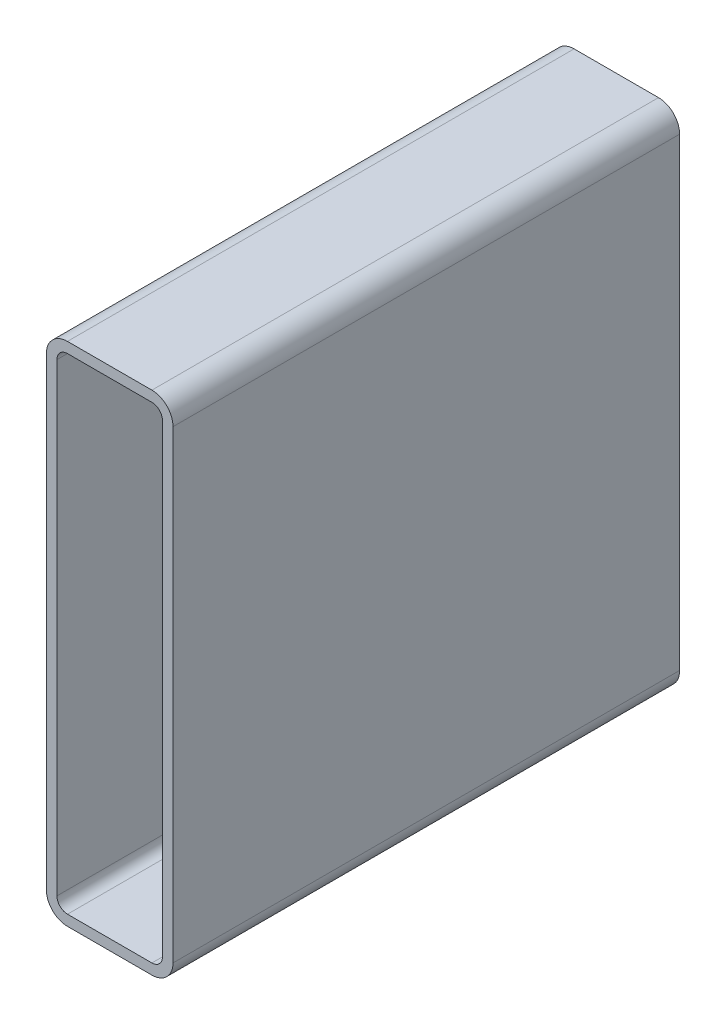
ISO-10303-21;
HEADER;
FILE_DESCRIPTION(('STEP AP214'),'2;1');
FILE_NAME('part.step','',(''),(''),'','','');
FILE_SCHEMA(('AUTOMOTIVE_DESIGN { 1 0 10303 214 1 1 1 1 }'));
ENDSEC;
DATA;
#1=APPLICATION_CONTEXT('core data for automotive mechanical design processes');
#2=APPLICATION_PROTOCOL_DEFINITION('international standard','automotive_design',2000,#1);
#3=PRODUCT_CONTEXT('',#1,'mechanical');
#4=PRODUCT('Part','Part','',(#3));
#5=PRODUCT_RELATED_PRODUCT_CATEGORY('part','',(#4));
#6=PRODUCT_DEFINITION_FORMATION('','',#4);
#7=PRODUCT_DEFINITION_CONTEXT('part definition',#1,'design');
#8=PRODUCT_DEFINITION('design','',#6,#7);
#9=PRODUCT_DEFINITION_SHAPE('','',#8);
#10=(LENGTH_UNIT() NAMED_UNIT(*) SI_UNIT(.MILLI.,.METRE.));
#11=(NAMED_UNIT(*) PLANE_ANGLE_UNIT() SI_UNIT($,.RADIAN.));
#12=(NAMED_UNIT(*) SI_UNIT($,.STERADIAN.) SOLID_ANGLE_UNIT());
#13=UNCERTAINTY_MEASURE_WITH_UNIT(LENGTH_MEASURE(1.E-05),#10,'distance_accuracy_value','');
#14=(GEOMETRIC_REPRESENTATION_CONTEXT(3) GLOBAL_UNCERTAINTY_ASSIGNED_CONTEXT((#13)) GLOBAL_UNIT_ASSIGNED_CONTEXT((#10,
#11,#12)) REPRESENTATION_CONTEXT('',''));
#15=CARTESIAN_POINT('',(0.,0.,0.));
#16=DIRECTION('',(0.,0.,1.));
#17=DIRECTION('',(1.,0.,0.));
#18=AXIS2_PLACEMENT_3D('',#15,#16,#17);
#19=CARTESIAN_POINT('',(15.1891160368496,293.974496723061,304.8));
#20=DIRECTION('',(0.,0.,1.));
#21=DIRECTION('',(1.,0.,0.));
#22=AXIS2_PLACEMENT_3D('',#19,#20,#21);
#23=PLANE('',#22);
#24=CARTESIAN_POINT('',(15.1891160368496,293.974496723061,304.8));
#25=DIRECTION('',(0.,0.,1.));
#26=DIRECTION('',(1.,0.,0.));
#27=AXIS2_PLACEMENT_3D('',#24,#25,#26);
#28=CIRCLE('',#27,12.7);
#29=CARTESIAN_POINT('',(15.1891160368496,306.674496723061,304.8));
#30=VERTEX_POINT('',#29);
#31=CARTESIAN_POINT('',(2.48911603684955,293.974496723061,304.8));
#32=VERTEX_POINT('',#31);
#33=EDGE_CURVE('E211',#30,#32,#28,.T.);
#34=ORIENTED_EDGE('',*,*,#33,.T.);
#35=DIRECTION('',(0.,-1.,0.));
#36=VECTOR('',#35,1.);
#37=CARTESIAN_POINT('',(2.48911603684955,14.5744967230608,304.8));
#38=LINE('',#37,#36);
#39=CARTESIAN_POINT('',(2.48911603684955,14.5744967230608,304.8));
#40=VERTEX_POINT('',#39);
#41=EDGE_CURVE('E214',#32,#40,#38,.T.);
#42=ORIENTED_EDGE('',*,*,#41,.T.);
#43=CARTESIAN_POINT('',(15.1891160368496,14.5744967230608,304.8));
#44=DIRECTION('',(0.,0.,1.));
#45=DIRECTION('',(1.,0.,0.));
#46=AXIS2_PLACEMENT_3D('',#43,#44,#45);
#47=CIRCLE('',#46,12.7);
#48=CARTESIAN_POINT('',(15.1891160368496,1.87449672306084,304.8));
#49=VERTEX_POINT('',#48);
#50=EDGE_CURVE('E217',#40,#49,#47,.T.);
#51=ORIENTED_EDGE('',*,*,#50,.T.);
#52=DIRECTION('',(1.,0.,0.));
#53=VECTOR('',#52,1.);
#54=CARTESIAN_POINT('',(65.9891160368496,1.87449672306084,304.8));
#55=LINE('',#54,#53);
#56=CARTESIAN_POINT('',(65.9891160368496,1.87449672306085,304.8));
#57=VERTEX_POINT('',#56);
#58=EDGE_CURVE('E219',#49,#57,#55,.T.);
#59=ORIENTED_EDGE('',*,*,#58,.T.);
#60=CARTESIAN_POINT('',(65.9891160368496,14.5744967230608,304.8));
#61=DIRECTION('',(0.,0.,1.));
#62=DIRECTION('',(1.,0.,0.));
#63=AXIS2_PLACEMENT_3D('',#60,#61,#62);
#64=CIRCLE('',#63,12.7);
#65=CARTESIAN_POINT('',(78.6891160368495,14.5744967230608,304.8));
#66=VERTEX_POINT('',#65);
#67=EDGE_CURVE('E221',#57,#66,#64,.T.);
#68=ORIENTED_EDGE('',*,*,#67,.T.);
#69=DIRECTION('',(0.,1.,0.));
#70=VECTOR('',#69,1.);
#71=CARTESIAN_POINT('',(78.6891160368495,293.974496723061,304.8));
#72=LINE('',#71,#70);
#73=CARTESIAN_POINT('',(78.6891160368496,293.974496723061,304.8));
#74=VERTEX_POINT('',#73);
#75=EDGE_CURVE('E223',#66,#74,#72,.T.);
#76=ORIENTED_EDGE('',*,*,#75,.T.);
#77=CARTESIAN_POINT('',(65.9891160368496,293.974496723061,304.8));
#78=DIRECTION('',(0.,0.,1.));
#79=DIRECTION('',(1.,0.,0.));
#80=AXIS2_PLACEMENT_3D('',#77,#78,#79);
#81=CIRCLE('',#80,12.7);
#82=CARTESIAN_POINT('',(65.9891160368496,306.674496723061,304.8));
#83=VERTEX_POINT('',#82);
#84=EDGE_CURVE('E225',#74,#83,#81,.T.);
#85=ORIENTED_EDGE('',*,*,#84,.T.);
#86=DIRECTION('',(-1.,0.,0.));
#87=VECTOR('',#86,1.);
#88=CARTESIAN_POINT('',(15.1891160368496,306.674496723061,304.8));
#89=LINE('',#88,#87);
#90=EDGE_CURVE('E227',#83,#30,#89,.T.);
#91=ORIENTED_EDGE('',*,*,#90,.T.);
#92=EDGE_LOOP('',(#34,#42,#51,#59,#68,#76,#85,#91));
#93=FACE_BOUND('',#92,.T.);
#94=DIRECTION('',(0.,-1.,0.));
#95=VECTOR('',#94,1.);
#96=CARTESIAN_POINT('',(8.83911603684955,14.5744967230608,304.8));
#97=LINE('',#96,#95);
#98=CARTESIAN_POINT('',(8.83911603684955,293.974496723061,304.8));
#99=VERTEX_POINT('',#98);
#100=CARTESIAN_POINT('',(8.83911603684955,14.5744967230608,304.8));
#101=VERTEX_POINT('',#100);
#102=EDGE_CURVE('E154',#99,#101,#97,.T.);
#103=ORIENTED_EDGE('',*,*,#102,.F.);
#104=CARTESIAN_POINT('',(15.1891160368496,293.974496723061,304.8));
#105=DIRECTION('',(0.,0.,1.));
#106=DIRECTION('',(1.,0.,0.));
#107=AXIS2_PLACEMENT_3D('',#104,#105,#106);
#108=CIRCLE('',#107,6.35000000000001);
#109=CARTESIAN_POINT('',(15.1891160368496,300.324496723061,304.8));
#110=VERTEX_POINT('',#109);
#111=EDGE_CURVE('E146',#110,#99,#108,.T.);
#112=ORIENTED_EDGE('',*,*,#111,.F.);
#113=DIRECTION('',(-1.,0.,0.));
#114=VECTOR('',#113,1.);
#115=CARTESIAN_POINT('',(15.1891160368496,300.324496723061,304.8));
#116=LINE('',#115,#114);
#117=CARTESIAN_POINT('',(65.9891160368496,300.324496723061,304.8));
#118=VERTEX_POINT('',#117);
#119=EDGE_CURVE('E179',#118,#110,#116,.T.);
#120=ORIENTED_EDGE('',*,*,#119,.F.);
#121=CARTESIAN_POINT('',(65.9891160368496,293.974496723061,304.8));
#122=DIRECTION('',(0.,0.,1.));
#123=DIRECTION('',(1.,0.,0.));
#124=AXIS2_PLACEMENT_3D('',#121,#122,#123);
#125=CIRCLE('',#124,6.35000000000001);
#126=CARTESIAN_POINT('',(72.3391160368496,293.974496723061,304.8));
#127=VERTEX_POINT('',#126);
#128=EDGE_CURVE('E177',#127,#118,#125,.T.);
#129=ORIENTED_EDGE('',*,*,#128,.F.);
#130=DIRECTION('',(0.,1.,0.));
#131=VECTOR('',#130,1.);
#132=CARTESIAN_POINT('',(72.3391160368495,293.974496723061,304.8));
#133=LINE('',#132,#131);
#134=CARTESIAN_POINT('',(72.3391160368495,14.5744967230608,304.8));
#135=VERTEX_POINT('',#134);
#136=EDGE_CURVE('E175',#135,#127,#133,.T.);
#137=ORIENTED_EDGE('',*,*,#136,.F.);
#138=CARTESIAN_POINT('',(65.9891160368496,14.5744967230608,304.8));
#139=DIRECTION('',(0.,0.,1.));
#140=DIRECTION('',(1.,0.,0.));
#141=AXIS2_PLACEMENT_3D('',#138,#139,#140);
#142=CIRCLE('',#141,6.35);
#143=CARTESIAN_POINT('',(65.9891160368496,8.22449672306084,304.8));
#144=VERTEX_POINT('',#143);
#145=EDGE_CURVE('E173',#144,#135,#142,.T.);
#146=ORIENTED_EDGE('',*,*,#145,.F.);
#147=DIRECTION('',(1.,0.,0.));
#148=VECTOR('',#147,1.);
#149=CARTESIAN_POINT('',(65.9891160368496,8.22449672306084,304.8));
#150=LINE('',#149,#148);
#151=CARTESIAN_POINT('',(15.1891160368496,8.22449672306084,304.8));
#152=VERTEX_POINT('',#151);
#153=EDGE_CURVE('E169',#152,#144,#150,.T.);
#154=ORIENTED_EDGE('',*,*,#153,.F.);
#155=CARTESIAN_POINT('',(15.1891160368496,14.5744967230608,304.8));
#156=DIRECTION('',(0.,0.,1.));
#157=DIRECTION('',(1.,0.,0.));
#158=AXIS2_PLACEMENT_3D('',#155,#156,#157);
#159=CIRCLE('',#158,6.35);
#160=EDGE_CURVE('E167',#101,#152,#159,.T.);
#161=ORIENTED_EDGE('',*,*,#160,.F.);
#162=EDGE_LOOP('',(#103,#112,#120,#129,#137,#146,#154,#161));
#163=FACE_BOUND('',#162,.T.);
#164=ADVANCED_FACE('F33',(#93,#163),#23,.T.);
#165=CARTESIAN_POINT('',(15.1891160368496,293.974496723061,0.));
#166=DIRECTION('',(0.,0.,1.));
#167=DIRECTION('',(1.,0.,0.));
#168=AXIS2_PLACEMENT_3D('',#165,#166,#167);
#169=PLANE('',#168);
#170=CARTESIAN_POINT('',(15.1891160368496,293.974496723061,0.));
#171=DIRECTION('',(0.,0.,1.));
#172=DIRECTION('',(1.,0.,0.));
#173=AXIS2_PLACEMENT_3D('',#170,#171,#172);
#174=CIRCLE('',#173,12.7);
#175=CARTESIAN_POINT('',(15.1891160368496,306.674496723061,0.));
#176=VERTEX_POINT('',#175);
#177=CARTESIAN_POINT('',(2.48911603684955,293.974496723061,0.));
#178=VERTEX_POINT('',#177);
#179=EDGE_CURVE('E162',#176,#178,#174,.T.);
#180=ORIENTED_EDGE('',*,*,#179,.F.);
#181=DIRECTION('',(-1.,0.,0.));
#182=VECTOR('',#181,1.);
#183=CARTESIAN_POINT('',(15.1891160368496,306.674496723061,0.));
#184=LINE('',#183,#182);
#185=CARTESIAN_POINT('',(65.9891160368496,306.674496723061,0.));
#186=VERTEX_POINT('',#185);
#187=EDGE_CURVE('E215',#186,#176,#184,.T.);
#188=ORIENTED_EDGE('',*,*,#187,.F.);
#189=CARTESIAN_POINT('',(65.9891160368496,293.974496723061,0.));
#190=DIRECTION('',(0.,0.,1.));
#191=DIRECTION('',(1.,0.,0.));
#192=AXIS2_PLACEMENT_3D('',#189,#190,#191);
#193=CIRCLE('',#192,12.7);
#194=CARTESIAN_POINT('',(78.6891160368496,293.974496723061,0.));
#195=VERTEX_POINT('',#194);
#196=EDGE_CURVE('E242',#195,#186,#193,.T.);
#197=ORIENTED_EDGE('',*,*,#196,.F.);
#198=DIRECTION('',(0.,1.,0.));
#199=VECTOR('',#198,1.);
#200=CARTESIAN_POINT('',(78.6891160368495,293.974496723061,0.));
#201=LINE('',#200,#199);
#202=CARTESIAN_POINT('',(78.6891160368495,14.5744967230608,0.));
#203=VERTEX_POINT('',#202);
#204=EDGE_CURVE('E240',#203,#195,#201,.T.);
#205=ORIENTED_EDGE('',*,*,#204,.F.);
#206=CARTESIAN_POINT('',(65.9891160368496,14.5744967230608,0.));
#207=DIRECTION('',(0.,0.,1.));
#208=DIRECTION('',(1.,0.,0.));
#209=AXIS2_PLACEMENT_3D('',#206,#207,#208);
#210=CIRCLE('',#209,12.7);
#211=CARTESIAN_POINT('',(65.9891160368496,1.87449672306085,0.));
#212=VERTEX_POINT('',#211);
#213=EDGE_CURVE('E238',#212,#203,#210,.T.);
#214=ORIENTED_EDGE('',*,*,#213,.F.);
#215=DIRECTION('',(1.,0.,0.));
#216=VECTOR('',#215,1.);
#217=CARTESIAN_POINT('',(65.9891160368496,1.87449672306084,0.));
#218=LINE('',#217,#216);
#219=CARTESIAN_POINT('',(15.1891160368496,1.87449672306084,0.));
#220=VERTEX_POINT('',#219);
#221=EDGE_CURVE('E236',#220,#212,#218,.T.);
#222=ORIENTED_EDGE('',*,*,#221,.F.);
#223=CARTESIAN_POINT('',(15.1891160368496,14.5744967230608,0.));
#224=DIRECTION('',(0.,0.,1.));
#225=DIRECTION('',(1.,0.,0.));
#226=AXIS2_PLACEMENT_3D('',#223,#224,#225);
#227=CIRCLE('',#226,12.7);
#228=CARTESIAN_POINT('',(2.48911603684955,14.5744967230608,0.));
#229=VERTEX_POINT('',#228);
#230=EDGE_CURVE('E234',#229,#220,#227,.T.);
#231=ORIENTED_EDGE('',*,*,#230,.F.);
#232=DIRECTION('',(0.,-1.,0.));
#233=VECTOR('',#232,1.);
#234=CARTESIAN_POINT('',(2.48911603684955,14.5744967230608,0.));
#235=LINE('',#234,#233);
#236=EDGE_CURVE('E232',#178,#229,#235,.T.);
#237=ORIENTED_EDGE('',*,*,#236,.F.);
#238=EDGE_LOOP('',(#180,#188,#197,#205,#214,#222,#231,#237));
#239=FACE_BOUND('',#238,.T.);
#240=CARTESIAN_POINT('',(15.1891160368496,293.974496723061,0.));
#241=DIRECTION('',(0.,0.,1.));
#242=DIRECTION('',(1.,0.,0.));
#243=AXIS2_PLACEMENT_3D('',#240,#241,#242);
#244=CIRCLE('',#243,6.35000000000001);
#245=CARTESIAN_POINT('',(15.1891160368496,300.324496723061,0.));
#246=VERTEX_POINT('',#245);
#247=CARTESIAN_POINT('',(8.83911603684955,293.974496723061,0.));
#248=VERTEX_POINT('',#247);
#249=EDGE_CURVE('E56',#246,#248,#244,.T.);
#250=ORIENTED_EDGE('',*,*,#249,.T.);
#251=DIRECTION('',(0.,-1.,0.));
#252=VECTOR('',#251,1.);
#253=CARTESIAN_POINT('',(8.83911603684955,14.5744967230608,0.));
#254=LINE('',#253,#252);
#255=CARTESIAN_POINT('',(8.83911603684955,14.5744967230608,0.));
#256=VERTEX_POINT('',#255);
#257=EDGE_CURVE('E161',#248,#256,#254,.T.);
#258=ORIENTED_EDGE('',*,*,#257,.T.);
#259=CARTESIAN_POINT('',(15.1891160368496,14.5744967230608,0.));
#260=DIRECTION('',(0.,0.,1.));
#261=DIRECTION('',(1.,0.,0.));
#262=AXIS2_PLACEMENT_3D('',#259,#260,#261);
#263=CIRCLE('',#262,6.35);
#264=CARTESIAN_POINT('',(15.1891160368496,8.22449672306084,0.));
#265=VERTEX_POINT('',#264);
#266=EDGE_CURVE('E183',#256,#265,#263,.T.);
#267=ORIENTED_EDGE('',*,*,#266,.T.);
#268=DIRECTION('',(1.,0.,0.));
#269=VECTOR('',#268,1.);
#270=CARTESIAN_POINT('',(65.9891160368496,8.22449672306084,0.));
#271=LINE('',#270,#269);
#272=CARTESIAN_POINT('',(65.9891160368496,8.22449672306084,0.));
#273=VERTEX_POINT('',#272);
#274=EDGE_CURVE('E186',#265,#273,#271,.T.);
#275=ORIENTED_EDGE('',*,*,#274,.T.);
#276=CARTESIAN_POINT('',(65.9891160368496,14.5744967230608,0.));
#277=DIRECTION('',(0.,0.,1.));
#278=DIRECTION('',(1.,0.,0.));
#279=AXIS2_PLACEMENT_3D('',#276,#277,#278);
#280=CIRCLE('',#279,6.35);
#281=CARTESIAN_POINT('',(72.3391160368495,14.5744967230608,0.));
#282=VERTEX_POINT('',#281);
#283=EDGE_CURVE('E189',#273,#282,#280,.T.);
#284=ORIENTED_EDGE('',*,*,#283,.T.);
#285=DIRECTION('',(0.,1.,0.));
#286=VECTOR('',#285,1.);
#287=CARTESIAN_POINT('',(72.3391160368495,293.974496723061,0.));
#288=LINE('',#287,#286);
#289=CARTESIAN_POINT('',(72.3391160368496,293.974496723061,0.));
#290=VERTEX_POINT('',#289);
#291=EDGE_CURVE('E192',#282,#290,#288,.T.);
#292=ORIENTED_EDGE('',*,*,#291,.T.);
#293=CARTESIAN_POINT('',(65.9891160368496,293.974496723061,0.));
#294=DIRECTION('',(0.,0.,1.));
#295=DIRECTION('',(1.,0.,0.));
#296=AXIS2_PLACEMENT_3D('',#293,#294,#295);
#297=CIRCLE('',#296,6.35000000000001);
#298=CARTESIAN_POINT('',(65.9891160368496,300.324496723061,0.));
#299=VERTEX_POINT('',#298);
#300=EDGE_CURVE('E195',#290,#299,#297,.T.);
#301=ORIENTED_EDGE('',*,*,#300,.T.);
#302=DIRECTION('',(-1.,0.,0.));
#303=VECTOR('',#302,1.);
#304=CARTESIAN_POINT('',(15.1891160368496,300.324496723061,0.));
#305=LINE('',#304,#303);
#306=EDGE_CURVE('E155',#299,#246,#305,.T.);
#307=ORIENTED_EDGE('',*,*,#306,.T.);
#308=EDGE_LOOP('',(#250,#258,#267,#275,#284,#292,#301,#307));
#309=FACE_BOUND('',#308,.T.);
#310=ADVANCED_FACE('F272',(#239,#309),#169,.F.);
#311=CARTESIAN_POINT('',(15.1891160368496,293.974496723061,304.8));
#312=DIRECTION('',(0.,0.,-1.));
#313=DIRECTION('',(-1.,0.,0.));
#314=AXIS2_PLACEMENT_3D('',#311,#312,#313);
#315=CYLINDRICAL_SURFACE('',#314,12.7);
#316=ORIENTED_EDGE('',*,*,#179,.T.);
#317=DIRECTION('',(0.,0.,-1.));
#318=VECTOR('',#317,1.);
#319=CARTESIAN_POINT('',(2.48911603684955,293.974496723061,304.8));
#320=LINE('',#319,#318);
#321=EDGE_CURVE('E11',#32,#178,#320,.T.);
#322=ORIENTED_EDGE('',*,*,#321,.F.);
#323=ORIENTED_EDGE('',*,*,#33,.F.);
#324=DIRECTION('',(0.,0.,-1.));
#325=VECTOR('',#324,1.);
#326=CARTESIAN_POINT('',(15.1891160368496,306.674496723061,304.8));
#327=LINE('',#326,#325);
#328=EDGE_CURVE('E229',#30,#176,#327,.T.);
#329=ORIENTED_EDGE('',*,*,#328,.T.);
#330=EDGE_LOOP('',(#316,#322,#323,#329));
#331=FACE_BOUND('',#330,.T.);
#332=ADVANCED_FACE('F35',(#331),#315,.T.);
#333=CARTESIAN_POINT('',(2.48911603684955,14.5744967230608,304.8));
#334=DIRECTION('',(1.,0.,0.));
#335=DIRECTION('',(0.,0.,-1.));
#336=AXIS2_PLACEMENT_3D('',#333,#334,#335);
#337=PLANE('',#336);
#338=ORIENTED_EDGE('',*,*,#236,.T.);
#339=DIRECTION('',(0.,0.,-1.));
#340=VECTOR('',#339,1.);
#341=CARTESIAN_POINT('',(2.48911603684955,14.5744967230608,304.8));
#342=LINE('',#341,#340);
#343=EDGE_CURVE('E41',#40,#229,#342,.T.);
#344=ORIENTED_EDGE('',*,*,#343,.F.);
#345=ORIENTED_EDGE('',*,*,#41,.F.);
#346=ORIENTED_EDGE('',*,*,#321,.T.);
#347=EDGE_LOOP('',(#338,#344,#345,#346));
#348=FACE_BOUND('',#347,.T.);
#349=ADVANCED_FACE('F289',(#348),#337,.F.);
#350=CARTESIAN_POINT('',(15.1891160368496,14.5744967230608,304.8));
#351=DIRECTION('',(0.,0.,-1.));
#352=DIRECTION('',(-1.,0.,0.));
#353=AXIS2_PLACEMENT_3D('',#350,#351,#352);
#354=CYLINDRICAL_SURFACE('',#353,12.7);
#355=ORIENTED_EDGE('',*,*,#230,.T.);
#356=DIRECTION('',(0.,0.,-1.));
#357=VECTOR('',#356,1.);
#358=CARTESIAN_POINT('',(15.1891160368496,1.87449672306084,304.8));
#359=LINE('',#358,#357);
#360=EDGE_CURVE('E259',#49,#220,#359,.T.);
#361=ORIENTED_EDGE('',*,*,#360,.F.);
#362=ORIENTED_EDGE('',*,*,#50,.F.);
#363=ORIENTED_EDGE('',*,*,#343,.T.);
#364=EDGE_LOOP('',(#355,#361,#362,#363));
#365=FACE_BOUND('',#364,.T.);
#366=ADVANCED_FACE('F266',(#365),#354,.T.);
#367=CARTESIAN_POINT('',(65.9891160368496,1.87449672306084,304.8));
#368=DIRECTION('',(0.,1.,0.));
#369=DIRECTION('',(0.,0.,1.));
#370=AXIS2_PLACEMENT_3D('',#367,#368,#369);
#371=PLANE('',#370);
#372=ORIENTED_EDGE('',*,*,#221,.T.);
#373=DIRECTION('',(0.,0.,-1.));
#374=VECTOR('',#373,1.);
#375=CARTESIAN_POINT('',(65.9891160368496,1.87449672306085,304.8));
#376=LINE('',#375,#374);
#377=EDGE_CURVE('E256',#57,#212,#376,.T.);
#378=ORIENTED_EDGE('',*,*,#377,.F.);
#379=ORIENTED_EDGE('',*,*,#58,.F.);
#380=ORIENTED_EDGE('',*,*,#360,.T.);
#381=EDGE_LOOP('',(#372,#378,#379,#380));
#382=FACE_BOUND('',#381,.T.);
#383=ADVANCED_FACE('F278',(#382),#371,.F.);
#384=CARTESIAN_POINT('',(65.9891160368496,14.5744967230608,304.8));
#385=DIRECTION('',(0.,0.,-1.));
#386=DIRECTION('',(-1.,0.,0.));
#387=AXIS2_PLACEMENT_3D('',#384,#385,#386);
#388=CYLINDRICAL_SURFACE('',#387,12.7);
#389=ORIENTED_EDGE('',*,*,#213,.T.);
#390=DIRECTION('',(0.,0.,-1.));
#391=VECTOR('',#390,1.);
#392=CARTESIAN_POINT('',(78.6891160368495,14.5744967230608,304.8));
#393=LINE('',#392,#391);
#394=EDGE_CURVE('E253',#66,#203,#393,.T.);
#395=ORIENTED_EDGE('',*,*,#394,.F.);
#396=ORIENTED_EDGE('',*,*,#67,.F.);
#397=ORIENTED_EDGE('',*,*,#377,.T.);
#398=EDGE_LOOP('',(#389,#395,#396,#397));
#399=FACE_BOUND('',#398,.T.);
#400=ADVANCED_FACE('F282',(#399),#388,.T.);
#401=CARTESIAN_POINT('',(78.6891160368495,293.974496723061,304.8));
#402=DIRECTION('',(-1.,0.,0.));
#403=DIRECTION('',(0.,0.,1.));
#404=AXIS2_PLACEMENT_3D('',#401,#402,#403);
#405=PLANE('',#404);
#406=ORIENTED_EDGE('',*,*,#204,.T.);
#407=DIRECTION('',(0.,0.,-1.));
#408=VECTOR('',#407,1.);
#409=CARTESIAN_POINT('',(78.6891160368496,293.974496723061,304.8));
#410=LINE('',#409,#408);
#411=EDGE_CURVE('E250',#74,#195,#410,.T.);
#412=ORIENTED_EDGE('',*,*,#411,.F.);
#413=ORIENTED_EDGE('',*,*,#75,.F.);
#414=ORIENTED_EDGE('',*,*,#394,.T.);
#415=EDGE_LOOP('',(#406,#412,#413,#414));
#416=FACE_BOUND('',#415,.T.);
#417=ADVANCED_FACE('F302',(#416),#405,.F.);
#418=CARTESIAN_POINT('',(65.9891160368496,293.974496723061,304.8));
#419=DIRECTION('',(0.,0.,-1.));
#420=DIRECTION('',(-1.,0.,0.));
#421=AXIS2_PLACEMENT_3D('',#418,#419,#420);
#422=CYLINDRICAL_SURFACE('',#421,12.7);
#423=ORIENTED_EDGE('',*,*,#196,.T.);
#424=DIRECTION('',(0.,0.,-1.));
#425=VECTOR('',#424,1.);
#426=CARTESIAN_POINT('',(65.9891160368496,306.674496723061,304.8));
#427=LINE('',#426,#425);
#428=EDGE_CURVE('E247',#83,#186,#427,.T.);
#429=ORIENTED_EDGE('',*,*,#428,.F.);
#430=ORIENTED_EDGE('',*,*,#84,.F.);
#431=ORIENTED_EDGE('',*,*,#411,.T.);
#432=EDGE_LOOP('',(#423,#429,#430,#431));
#433=FACE_BOUND('',#432,.T.);
#434=ADVANCED_FACE('F300',(#433),#422,.T.);
#435=CARTESIAN_POINT('',(15.1891160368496,306.674496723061,304.8));
#436=DIRECTION('',(0.,-1.,0.));
#437=DIRECTION('',(0.,0.,-1.));
#438=AXIS2_PLACEMENT_3D('',#435,#436,#437);
#439=PLANE('',#438);
#440=ORIENTED_EDGE('',*,*,#187,.T.);
#441=ORIENTED_EDGE('',*,*,#328,.F.);
#442=ORIENTED_EDGE('',*,*,#90,.F.);
#443=ORIENTED_EDGE('',*,*,#428,.T.);
#444=EDGE_LOOP('',(#440,#441,#442,#443));
#445=FACE_BOUND('',#444,.T.);
#446=ADVANCED_FACE('F295',(#445),#439,.F.);
#447=CARTESIAN_POINT('',(15.1891160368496,293.974496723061,304.8));
#448=DIRECTION('',(0.,0.,-1.));
#449=DIRECTION('',(-1.,0.,0.));
#450=AXIS2_PLACEMENT_3D('',#447,#448,#449);
#451=CYLINDRICAL_SURFACE('',#450,6.35000000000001);
#452=ORIENTED_EDGE('',*,*,#249,.F.);
#453=DIRECTION('',(0.,0.,-1.));
#454=VECTOR('',#453,1.);
#455=CARTESIAN_POINT('',(15.1891160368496,300.324496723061,304.8));
#456=LINE('',#455,#454);
#457=EDGE_CURVE('E150',#110,#246,#456,.T.);
#458=ORIENTED_EDGE('',*,*,#457,.F.);
#459=ORIENTED_EDGE('',*,*,#111,.T.);
#460=DIRECTION('',(0.,0.,-1.));
#461=VECTOR('',#460,1.);
#462=CARTESIAN_POINT('',(8.83911603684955,293.974496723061,304.8));
#463=LINE('',#462,#461);
#464=EDGE_CURVE('E149',#99,#248,#463,.T.);
#465=ORIENTED_EDGE('',*,*,#464,.T.);
#466=EDGE_LOOP('',(#452,#458,#459,#465));
#467=FACE_BOUND('',#466,.T.);
#468=ADVANCED_FACE('F148',(#467),#451,.F.);
#469=CARTESIAN_POINT('',(8.83911603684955,14.5744967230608,304.8));
#470=DIRECTION('',(1.,0.,0.));
#471=DIRECTION('',(0.,0.,-1.));
#472=AXIS2_PLACEMENT_3D('',#469,#470,#471);
#473=PLANE('',#472);
#474=ORIENTED_EDGE('',*,*,#257,.F.);
#475=ORIENTED_EDGE('',*,*,#464,.F.);
#476=ORIENTED_EDGE('',*,*,#102,.T.);
#477=DIRECTION('',(0.,0.,-1.));
#478=VECTOR('',#477,1.);
#479=CARTESIAN_POINT('',(8.83911603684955,14.5744967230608,304.8));
#480=LINE('',#479,#478);
#481=EDGE_CURVE('E163',#101,#256,#480,.T.);
#482=ORIENTED_EDGE('',*,*,#481,.T.);
#483=EDGE_LOOP('',(#474,#475,#476,#482));
#484=FACE_BOUND('',#483,.T.);
#485=ADVANCED_FACE('F158',(#484),#473,.T.);
#486=CARTESIAN_POINT('',(15.1891160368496,14.5744967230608,304.8));
#487=DIRECTION('',(0.,0.,-1.));
#488=DIRECTION('',(-1.,0.,0.));
#489=AXIS2_PLACEMENT_3D('',#486,#487,#488);
#490=CYLINDRICAL_SURFACE('',#489,6.35);
#491=ORIENTED_EDGE('',*,*,#266,.F.);
#492=ORIENTED_EDGE('',*,*,#481,.F.);
#493=ORIENTED_EDGE('',*,*,#160,.T.);
#494=DIRECTION('',(0.,0.,-1.));
#495=VECTOR('',#494,1.);
#496=CARTESIAN_POINT('',(15.1891160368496,8.22449672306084,304.8));
#497=LINE('',#496,#495);
#498=EDGE_CURVE('E208',#152,#265,#497,.T.);
#499=ORIENTED_EDGE('',*,*,#498,.T.);
#500=EDGE_LOOP('',(#491,#492,#493,#499));
#501=FACE_BOUND('',#500,.T.);
#502=ADVANCED_FACE('F327',(#501),#490,.F.);
#503=CARTESIAN_POINT('',(65.9891160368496,8.22449672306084,304.8));
#504=DIRECTION('',(0.,1.,0.));
#505=DIRECTION('',(0.,0.,1.));
#506=AXIS2_PLACEMENT_3D('',#503,#504,#505);
#507=PLANE('',#506);
#508=ORIENTED_EDGE('',*,*,#274,.F.);
#509=ORIENTED_EDGE('',*,*,#498,.F.);
#510=ORIENTED_EDGE('',*,*,#153,.T.);
#511=DIRECTION('',(0.,0.,-1.));
#512=VECTOR('',#511,1.);
#513=CARTESIAN_POINT('',(65.9891160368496,8.22449672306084,304.8));
#514=LINE('',#513,#512);
#515=EDGE_CURVE('E206',#144,#273,#514,.T.);
#516=ORIENTED_EDGE('',*,*,#515,.T.);
#517=EDGE_LOOP('',(#508,#509,#510,#516));
#518=FACE_BOUND('',#517,.T.);
#519=ADVANCED_FACE('F331',(#518),#507,.T.);
#520=CARTESIAN_POINT('',(65.9891160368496,14.5744967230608,304.8));
#521=DIRECTION('',(0.,0.,-1.));
#522=DIRECTION('',(-1.,0.,0.));
#523=AXIS2_PLACEMENT_3D('',#520,#521,#522);
#524=CYLINDRICAL_SURFACE('',#523,6.35);
#525=ORIENTED_EDGE('',*,*,#283,.F.);
#526=ORIENTED_EDGE('',*,*,#515,.F.);
#527=ORIENTED_EDGE('',*,*,#145,.T.);
#528=DIRECTION('',(0.,0.,-1.));
#529=VECTOR('',#528,1.);
#530=CARTESIAN_POINT('',(72.3391160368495,14.5744967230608,304.8));
#531=LINE('',#530,#529);
#532=EDGE_CURVE('E204',#135,#282,#531,.T.);
#533=ORIENTED_EDGE('',*,*,#532,.T.);
#534=EDGE_LOOP('',(#525,#526,#527,#533));
#535=FACE_BOUND('',#534,.T.);
#536=ADVANCED_FACE('F337',(#535),#524,.F.);
#537=CARTESIAN_POINT('',(72.3391160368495,293.974496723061,304.8));
#538=DIRECTION('',(-1.,0.,0.));
#539=DIRECTION('',(0.,0.,1.));
#540=AXIS2_PLACEMENT_3D('',#537,#538,#539);
#541=PLANE('',#540);
#542=ORIENTED_EDGE('',*,*,#291,.F.);
#543=ORIENTED_EDGE('',*,*,#532,.F.);
#544=ORIENTED_EDGE('',*,*,#136,.T.);
#545=DIRECTION('',(0.,0.,-1.));
#546=VECTOR('',#545,1.);
#547=CARTESIAN_POINT('',(72.3391160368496,293.974496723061,304.8));
#548=LINE('',#547,#546);
#549=EDGE_CURVE('E202',#127,#290,#548,.T.);
#550=ORIENTED_EDGE('',*,*,#549,.T.);
#551=EDGE_LOOP('',(#542,#543,#544,#550));
#552=FACE_BOUND('',#551,.T.);
#553=ADVANCED_FACE('F341',(#552),#541,.T.);
#554=CARTESIAN_POINT('',(65.9891160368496,293.974496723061,304.8));
#555=DIRECTION('',(0.,0.,-1.));
#556=DIRECTION('',(-1.,0.,0.));
#557=AXIS2_PLACEMENT_3D('',#554,#555,#556);
#558=CYLINDRICAL_SURFACE('',#557,6.35000000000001);
#559=ORIENTED_EDGE('',*,*,#300,.F.);
#560=ORIENTED_EDGE('',*,*,#549,.F.);
#561=ORIENTED_EDGE('',*,*,#128,.T.);
#562=DIRECTION('',(0.,0.,-1.));
#563=VECTOR('',#562,1.);
#564=CARTESIAN_POINT('',(65.9891160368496,300.324496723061,304.8));
#565=LINE('',#564,#563);
#566=EDGE_CURVE('E48',#118,#299,#565,.T.);
#567=ORIENTED_EDGE('',*,*,#566,.T.);
#568=EDGE_LOOP('',(#559,#560,#561,#567));
#569=FACE_BOUND('',#568,.T.);
#570=ADVANCED_FACE('F345',(#569),#558,.F.);
#571=CARTESIAN_POINT('',(15.1891160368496,300.324496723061,304.8));
#572=DIRECTION('',(0.,-1.,0.));
#573=DIRECTION('',(0.,0.,-1.));
#574=AXIS2_PLACEMENT_3D('',#571,#572,#573);
#575=PLANE('',#574);
#576=ORIENTED_EDGE('',*,*,#306,.F.);
#577=ORIENTED_EDGE('',*,*,#566,.F.);
#578=ORIENTED_EDGE('',*,*,#119,.T.);
#579=ORIENTED_EDGE('',*,*,#457,.T.);
#580=EDGE_LOOP('',(#576,#577,#578,#579));
#581=FACE_BOUND('',#580,.T.);
#582=ADVANCED_FACE('F349',(#581),#575,.T.);
#583=CLOSED_SHELL('',(#164,#310,#332,#349,#366,#383,#400,#417,#434,#446,#468,#485,#502,#519,
#536,#553,#570,#582));
#584=MANIFOLD_SOLID_BREP('B2',#583);
#585=ADVANCED_BREP_SHAPE_REPRESENTATION('',(#18,#584),#14);
#586=SHAPE_DEFINITION_REPRESENTATION(#9,#585);
ENDSEC;
END-ISO-10303-21;
